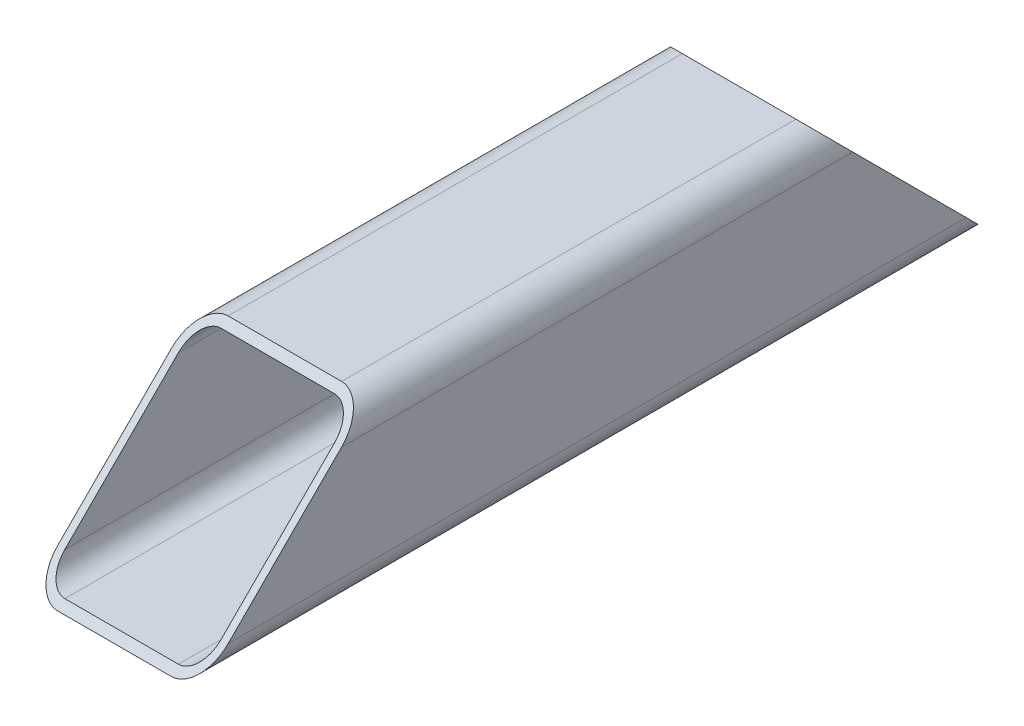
ISO-10303-21;
HEADER;
FILE_DESCRIPTION(('STEP AP214'),'2;1');
FILE_NAME('part.step','',(''),(''),'','','');
FILE_SCHEMA(('AUTOMOTIVE_DESIGN { 1 0 10303 214 1 1 1 1 }'));
ENDSEC;
DATA;
#1=APPLICATION_CONTEXT('core data for automotive mechanical design processes');
#2=APPLICATION_PROTOCOL_DEFINITION('international standard','automotive_design',2000,#1);
#3=PRODUCT_CONTEXT('',#1,'mechanical');
#4=PRODUCT('Part','Part','',(#3));
#5=PRODUCT_RELATED_PRODUCT_CATEGORY('part','',(#4));
#6=PRODUCT_DEFINITION_FORMATION('','',#4);
#7=PRODUCT_DEFINITION_CONTEXT('part definition',#1,'design');
#8=PRODUCT_DEFINITION('design','',#6,#7);
#9=PRODUCT_DEFINITION_SHAPE('','',#8);
#10=(LENGTH_UNIT() NAMED_UNIT(*) SI_UNIT(.MILLI.,.METRE.));
#11=(NAMED_UNIT(*) PLANE_ANGLE_UNIT() SI_UNIT($,.RADIAN.));
#12=(NAMED_UNIT(*) SI_UNIT($,.STERADIAN.) SOLID_ANGLE_UNIT());
#13=UNCERTAINTY_MEASURE_WITH_UNIT(LENGTH_MEASURE(1.E-05),#10,'distance_accuracy_value','');
#14=(GEOMETRIC_REPRESENTATION_CONTEXT(3) GLOBAL_UNCERTAINTY_ASSIGNED_CONTEXT((#13)) GLOBAL_UNIT_ASSIGNED_CONTEXT((#10,
#11,#12)) REPRESENTATION_CONTEXT('',''));
#15=CARTESIAN_POINT('',(0.,0.,0.));
#16=DIRECTION('',(0.,0.,1.));
#17=DIRECTION('',(1.,0.,0.));
#18=AXIS2_PLACEMENT_3D('',#15,#16,#17);
#19=CARTESIAN_POINT('',(25.4,25.4,355.6));
#20=DIRECTION('',(0.,0.,-1.));
#21=DIRECTION('',(-1.,0.,0.));
#22=AXIS2_PLACEMENT_3D('',#19,#20,#21);
#23=CYLINDRICAL_SURFACE('',#22,12.7);
#24=DIRECTION('',(0.,0.,-1.));
#25=VECTOR('',#24,1.);
#26=CARTESIAN_POINT('',(38.1,25.4,355.6));
#27=LINE('',#26,#25);
#28=CARTESIAN_POINT('',(38.1,25.4,292.1));
#29=VERTEX_POINT('',#28);
#30=CARTESIAN_POINT('',(38.1,25.4,63.5000000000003));
#31=VERTEX_POINT('',#30);
#32=EDGE_CURVE('E177',#29,#31,#27,.T.);
#33=ORIENTED_EDGE('',*,*,#32,.T.);
#34=CARTESIAN_POINT('',(25.4,25.4,63.5000000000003));
#35=DIRECTION('',(0.,-0.707106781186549,0.707106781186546));
#36=DIRECTION('',(0.,-0.707106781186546,-0.707106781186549));
#37=AXIS2_PLACEMENT_3D('',#34,#35,#36);
#38=ELLIPSE('',#37,17.9605122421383,12.7);
#39=CARTESIAN_POINT('',(25.4,38.1,76.2000000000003));
#40=VERTEX_POINT('',#39);
#41=EDGE_CURVE('E48',#31,#40,#38,.T.);
#42=ORIENTED_EDGE('',*,*,#41,.T.);
#43=DIRECTION('',(0.,0.,-1.));
#44=VECTOR('',#43,1.);
#45=CARTESIAN_POINT('',(25.4,38.1,355.6));
#46=LINE('',#45,#44);
#47=CARTESIAN_POINT('',(25.4,38.1,279.4));
#48=VERTEX_POINT('',#47);
#49=EDGE_CURVE('E41',#48,#40,#46,.T.);
#50=ORIENTED_EDGE('',*,*,#49,.F.);
#51=CARTESIAN_POINT('',(25.4,25.4,292.1));
#52=DIRECTION('',(0.,0.707106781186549,0.707106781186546));
#53=DIRECTION('',(0.,0.707106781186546,-0.707106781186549));
#54=AXIS2_PLACEMENT_3D('',#51,#52,#53);
#55=ELLIPSE('',#54,17.9605122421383,12.7);
#56=EDGE_CURVE('E256',#29,#48,#55,.T.);
#57=ORIENTED_EDGE('',*,*,#56,.F.);
#58=EDGE_LOOP('',(#33,#42,#50,#57));
#59=FACE_BOUND('',#58,.T.);
#60=ADVANCED_FACE('F34',(#59),#23,.T.);
#61=CARTESIAN_POINT('',(-25.4,38.1,355.6));
#62=DIRECTION('',(0.,1.,0.));
#63=DIRECTION('',(-1.,0.,0.));
#64=AXIS2_PLACEMENT_3D('',#61,#62,#63);
#65=PLANE('',#64);
#66=DIRECTION('',(-1.,0.,0.));
#67=VECTOR('',#66,1.);
#68=CARTESIAN_POINT('',(38.1,38.1,76.2000000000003));
#69=LINE('',#68,#67);
#70=CARTESIAN_POINT('',(-25.4,38.1,76.2000000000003));
#71=VERTEX_POINT('',#70);
#72=EDGE_CURVE('E55',#40,#71,#69,.T.);
#73=ORIENTED_EDGE('',*,*,#72,.T.);
#74=DIRECTION('',(0.,0.,-1.));
#75=VECTOR('',#74,1.);
#76=CARTESIAN_POINT('',(-25.4,38.1,355.6));
#77=LINE('',#76,#75);
#78=CARTESIAN_POINT('',(-25.4,38.1,279.4));
#79=VERTEX_POINT('',#78);
#80=EDGE_CURVE('E192',#79,#71,#77,.T.);
#81=ORIENTED_EDGE('',*,*,#80,.F.);
#82=DIRECTION('',(-1.,0.,0.));
#83=VECTOR('',#82,1.);
#84=CARTESIAN_POINT('',(38.1,38.1,279.4));
#85=LINE('',#84,#83);
#86=EDGE_CURVE('E195',#48,#79,#85,.T.);
#87=ORIENTED_EDGE('',*,*,#86,.F.);
#88=ORIENTED_EDGE('',*,*,#49,.T.);
#89=EDGE_LOOP('',(#73,#81,#87,#88));
#90=FACE_BOUND('',#89,.T.);
#91=ADVANCED_FACE('F193',(#90),#65,.T.);
#92=CARTESIAN_POINT('',(-25.4,25.4,355.6));
#93=DIRECTION('',(0.,0.,-1.));
#94=DIRECTION('',(-1.,0.,0.));
#95=AXIS2_PLACEMENT_3D('',#92,#93,#94);
#96=CYLINDRICAL_SURFACE('',#95,12.7);
#97=CARTESIAN_POINT('',(-25.4,25.4,63.5000000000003));
#98=DIRECTION('',(0.,-0.707106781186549,0.707106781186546));
#99=DIRECTION('',(0.,-0.707106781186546,-0.707106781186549));
#100=AXIS2_PLACEMENT_3D('',#97,#98,#99);
#101=ELLIPSE('',#100,17.9605122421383,12.7);
#102=CARTESIAN_POINT('',(-38.1,25.4,63.5000000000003));
#103=VERTEX_POINT('',#102);
#104=EDGE_CURVE('E199',#103,#71,#101,.F.);
#105=ORIENTED_EDGE('',*,*,#104,.F.);
#106=DIRECTION('',(0.,0.,-1.));
#107=VECTOR('',#106,1.);
#108=CARTESIAN_POINT('',(-38.1,25.4,355.6));
#109=LINE('',#108,#107);
#110=CARTESIAN_POINT('',(-38.1,25.4000000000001,292.1));
#111=VERTEX_POINT('',#110);
#112=EDGE_CURVE('E189',#111,#103,#109,.T.);
#113=ORIENTED_EDGE('',*,*,#112,.F.);
#114=CARTESIAN_POINT('',(-25.4,25.4,292.1));
#115=DIRECTION('',(0.,0.707106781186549,0.707106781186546));
#116=DIRECTION('',(0.,0.707106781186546,-0.707106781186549));
#117=AXIS2_PLACEMENT_3D('',#114,#115,#116);
#118=ELLIPSE('',#117,17.9605122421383,12.7);
#119=EDGE_CURVE('E254',#111,#79,#118,.F.);
#120=ORIENTED_EDGE('',*,*,#119,.T.);
#121=ORIENTED_EDGE('',*,*,#80,.T.);
#122=EDGE_LOOP('',(#105,#113,#120,#121));
#123=FACE_BOUND('',#122,.T.);
#124=ADVANCED_FACE('F327',(#123),#96,.T.);
#125=CARTESIAN_POINT('',(-38.1,25.4,355.6));
#126=DIRECTION('',(1.,0.,0.));
#127=DIRECTION('',(0.,1.,0.));
#128=AXIS2_PLACEMENT_3D('',#125,#126,#127);
#129=PLANE('',#128);
#130=ORIENTED_EDGE('',*,*,#112,.T.);
#131=DIRECTION('',(0.,-0.707106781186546,-0.707106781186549));
#132=VECTOR('',#131,1.);
#133=CARTESIAN_POINT('',(-38.1,171.45,209.550000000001));
#134=LINE('',#133,#132);
#135=CARTESIAN_POINT('',(-38.1,-25.4,12.7));
#136=VERTEX_POINT('',#135);
#137=EDGE_CURVE('E170',#103,#136,#134,.T.);
#138=ORIENTED_EDGE('',*,*,#137,.T.);
#139=DIRECTION('',(0.,0.,-1.));
#140=VECTOR('',#139,1.);
#141=CARTESIAN_POINT('',(-38.1,-25.4,355.6));
#142=LINE('',#141,#140);
#143=CARTESIAN_POINT('',(-38.1,-25.4,342.9));
#144=VERTEX_POINT('',#143);
#145=EDGE_CURVE('E160',#144,#136,#142,.T.);
#146=ORIENTED_EDGE('',*,*,#145,.F.);
#147=DIRECTION('',(0.,-0.707106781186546,0.707106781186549));
#148=VECTOR('',#147,1.);
#149=CARTESIAN_POINT('',(-38.1,-6.35000000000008,323.85));
#150=LINE('',#149,#148);
#151=EDGE_CURVE('E251',#111,#144,#150,.T.);
#152=ORIENTED_EDGE('',*,*,#151,.F.);
#153=EDGE_LOOP('',(#130,#138,#146,#152));
#154=FACE_BOUND('',#153,.T.);
#155=ADVANCED_FACE('F336',(#154),#129,.F.);
#156=CARTESIAN_POINT('',(-25.4,-25.4,355.6));
#157=DIRECTION('',(0.,0.,-1.));
#158=DIRECTION('',(-1.,0.,0.));
#159=AXIS2_PLACEMENT_3D('',#156,#157,#158);
#160=CYLINDRICAL_SURFACE('',#159,12.7);
#161=CARTESIAN_POINT('',(-25.4,-25.4,12.7));
#162=DIRECTION('',(0.,-0.707106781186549,0.707106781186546));
#163=DIRECTION('',(0.,-0.707106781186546,-0.707106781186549));
#164=AXIS2_PLACEMENT_3D('',#161,#162,#163);
#165=ELLIPSE('',#164,17.9605122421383,12.7);
#166=CARTESIAN_POINT('',(-25.4,-38.1,0.));
#167=VERTEX_POINT('',#166);
#168=EDGE_CURVE('E165',#167,#136,#165,.F.);
#169=ORIENTED_EDGE('',*,*,#168,.F.);
#170=DIRECTION('',(0.,0.,-1.));
#171=VECTOR('',#170,1.);
#172=CARTESIAN_POINT('',(-25.4,-38.1,355.6));
#173=LINE('',#172,#171);
#174=CARTESIAN_POINT('',(-25.4,-38.1,355.6));
#175=VERTEX_POINT('',#174);
#176=EDGE_CURVE('E149',#175,#167,#173,.T.);
#177=ORIENTED_EDGE('',*,*,#176,.F.);
#178=CARTESIAN_POINT('',(-25.4,-25.4,342.9));
#179=DIRECTION('',(0.,0.707106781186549,0.707106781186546));
#180=DIRECTION('',(0.,0.707106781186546,-0.707106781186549));
#181=AXIS2_PLACEMENT_3D('',#178,#179,#180);
#182=ELLIPSE('',#181,17.9605122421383,12.7);
#183=EDGE_CURVE('E249',#175,#144,#182,.F.);
#184=ORIENTED_EDGE('',*,*,#183,.T.);
#185=ORIENTED_EDGE('',*,*,#145,.T.);
#186=EDGE_LOOP('',(#169,#177,#184,#185));
#187=FACE_BOUND('',#186,.T.);
#188=ADVANCED_FACE('F166',(#187),#160,.T.);
#189=CARTESIAN_POINT('',(25.4,-25.4,355.6));
#190=DIRECTION('',(0.,0.,-1.));
#191=DIRECTION('',(-1.,0.,0.));
#192=AXIS2_PLACEMENT_3D('',#189,#190,#191);
#193=CYLINDRICAL_SURFACE('',#192,12.7);
#194=CARTESIAN_POINT('',(25.4,-25.4,12.7));
#195=DIRECTION('',(0.,-0.707106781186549,0.707106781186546));
#196=DIRECTION('',(0.,-0.707106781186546,-0.707106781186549));
#197=AXIS2_PLACEMENT_3D('',#194,#195,#196);
#198=ELLIPSE('',#197,17.9605122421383,12.7);
#199=CARTESIAN_POINT('',(38.1,-25.4000000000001,12.7));
#200=VERTEX_POINT('',#199);
#201=CARTESIAN_POINT('',(25.4,-38.1,0.));
#202=VERTEX_POINT('',#201);
#203=EDGE_CURVE('E171',#200,#202,#198,.F.);
#204=ORIENTED_EDGE('',*,*,#203,.F.);
#205=DIRECTION('',(0.,0.,-1.));
#206=VECTOR('',#205,1.);
#207=CARTESIAN_POINT('',(38.1,-25.4000000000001,355.6));
#208=LINE('',#207,#206);
#209=CARTESIAN_POINT('',(38.1,-25.4000000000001,342.9));
#210=VERTEX_POINT('',#209);
#211=EDGE_CURVE('E184',#210,#200,#208,.T.);
#212=ORIENTED_EDGE('',*,*,#211,.F.);
#213=CARTESIAN_POINT('',(25.4,-25.4,342.9));
#214=DIRECTION('',(0.,0.707106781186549,0.707106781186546));
#215=DIRECTION('',(0.,0.707106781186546,-0.707106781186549));
#216=AXIS2_PLACEMENT_3D('',#213,#214,#215);
#217=ELLIPSE('',#216,17.9605122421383,12.7);
#218=CARTESIAN_POINT('',(25.4,-38.1,355.6));
#219=VERTEX_POINT('',#218);
#220=EDGE_CURVE('E247',#210,#219,#217,.F.);
#221=ORIENTED_EDGE('',*,*,#220,.T.);
#222=DIRECTION('',(0.,0.,-1.));
#223=VECTOR('',#222,1.);
#224=CARTESIAN_POINT('',(25.4,-38.1,355.6));
#225=LINE('',#224,#223);
#226=EDGE_CURVE('E161',#219,#202,#225,.T.);
#227=ORIENTED_EDGE('',*,*,#226,.T.);
#228=EDGE_LOOP('',(#204,#212,#221,#227));
#229=FACE_BOUND('',#228,.T.);
#230=ADVANCED_FACE('F333',(#229),#193,.T.);
#231=CARTESIAN_POINT('',(38.1,-25.4000000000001,355.6));
#232=DIRECTION('',(-1.,0.,0.));
#233=DIRECTION('',(0.,-1.,0.));
#234=AXIS2_PLACEMENT_3D('',#231,#232,#233);
#235=PLANE('',#234);
#236=ORIENTED_EDGE('',*,*,#211,.T.);
#237=DIRECTION('',(0.,0.707106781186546,0.707106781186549));
#238=VECTOR('',#237,1.);
#239=CARTESIAN_POINT('',(38.1,-38.1,0.));
#240=LINE('',#239,#238);
#241=EDGE_CURVE('E201',#200,#31,#240,.T.);
#242=ORIENTED_EDGE('',*,*,#241,.T.);
#243=ORIENTED_EDGE('',*,*,#32,.F.);
#244=DIRECTION('',(0.,0.707106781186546,-0.707106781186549));
#245=VECTOR('',#244,1.);
#246=CARTESIAN_POINT('',(38.1,-38.1,355.6));
#247=LINE('',#246,#245);
#248=EDGE_CURVE('E227',#210,#29,#247,.T.);
#249=ORIENTED_EDGE('',*,*,#248,.F.);
#250=EDGE_LOOP('',(#236,#242,#243,#249));
#251=FACE_BOUND('',#250,.T.);
#252=ADVANCED_FACE('F329',(#251),#235,.F.);
#253=CARTESIAN_POINT('',(25.4,25.4,355.6));
#254=DIRECTION('',(0.,0.,-1.));
#255=DIRECTION('',(-1.,0.,0.));
#256=AXIS2_PLACEMENT_3D('',#253,#254,#255);
#257=CYLINDRICAL_SURFACE('',#256,9.525);
#258=CARTESIAN_POINT('',(25.4,25.4,63.5000000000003));
#259=DIRECTION('',(0.,-0.707106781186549,0.707106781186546));
#260=DIRECTION('',(0.,-0.707106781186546,-0.707106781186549));
#261=AXIS2_PLACEMENT_3D('',#258,#259,#260);
#262=ELLIPSE('',#261,13.4703841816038,9.525);
#263=CARTESIAN_POINT('',(34.925,25.4,63.5000000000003));
#264=VERTEX_POINT('',#263);
#265=CARTESIAN_POINT('',(25.4,34.925,73.0250000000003));
#266=VERTEX_POINT('',#265);
#267=EDGE_CURVE('E220',#264,#266,#262,.T.);
#268=ORIENTED_EDGE('',*,*,#267,.F.);
#269=DIRECTION('',(0.,0.,-1.));
#270=VECTOR('',#269,1.);
#271=CARTESIAN_POINT('',(34.925,25.4,355.6));
#272=LINE('',#271,#270);
#273=CARTESIAN_POINT('',(34.925,25.4,292.1));
#274=VERTEX_POINT('',#273);
#275=EDGE_CURVE('E258',#274,#264,#272,.T.);
#276=ORIENTED_EDGE('',*,*,#275,.F.);
#277=CARTESIAN_POINT('',(25.4,25.4,292.1));
#278=DIRECTION('',(0.,0.707106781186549,0.707106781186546));
#279=DIRECTION('',(0.,0.707106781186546,-0.707106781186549));
#280=AXIS2_PLACEMENT_3D('',#277,#278,#279);
#281=ELLIPSE('',#280,13.4703841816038,9.525);
#282=CARTESIAN_POINT('',(25.4,34.925,282.575));
#283=VERTEX_POINT('',#282);
#284=EDGE_CURVE('E244',#274,#283,#281,.T.);
#285=ORIENTED_EDGE('',*,*,#284,.T.);
#286=DIRECTION('',(0.,0.,-1.));
#287=VECTOR('',#286,1.);
#288=CARTESIAN_POINT('',(25.4,34.925,355.6));
#289=LINE('',#288,#287);
#290=EDGE_CURVE('E175',#283,#266,#289,.T.);
#291=ORIENTED_EDGE('',*,*,#290,.T.);
#292=EDGE_LOOP('',(#268,#276,#285,#291));
#293=FACE_BOUND('',#292,.T.);
#294=ADVANCED_FACE('F290',(#293),#257,.F.);
#295=CARTESIAN_POINT('',(-25.4,34.925,355.6));
#296=DIRECTION('',(0.,1.,0.));
#297=DIRECTION('',(-1.,0.,0.));
#298=AXIS2_PLACEMENT_3D('',#295,#296,#297);
#299=PLANE('',#298);
#300=DIRECTION('',(0.,0.,-1.));
#301=VECTOR('',#300,1.);
#302=CARTESIAN_POINT('',(-25.4,34.925,355.6));
#303=LINE('',#302,#301);
#304=CARTESIAN_POINT('',(-25.4,34.925,282.575));
#305=VERTEX_POINT('',#304);
#306=CARTESIAN_POINT('',(-25.4,34.925,73.0250000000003));
#307=VERTEX_POINT('',#306);
#308=EDGE_CURVE('E180',#305,#307,#303,.T.);
#309=ORIENTED_EDGE('',*,*,#308,.T.);
#310=DIRECTION('',(1.,0.,0.));
#311=VECTOR('',#310,1.);
#312=CARTESIAN_POINT('',(-25.3999999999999,34.925,73.0250000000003));
#313=LINE('',#312,#311);
#314=EDGE_CURVE('E218',#307,#266,#313,.T.);
#315=ORIENTED_EDGE('',*,*,#314,.T.);
#316=ORIENTED_EDGE('',*,*,#290,.F.);
#317=DIRECTION('',(1.,0.,0.));
#318=VECTOR('',#317,1.);
#319=CARTESIAN_POINT('',(-25.4,34.925,282.575));
#320=LINE('',#319,#318);
#321=EDGE_CURVE('E242',#305,#283,#320,.T.);
#322=ORIENTED_EDGE('',*,*,#321,.F.);
#323=EDGE_LOOP('',(#309,#315,#316,#322));
#324=FACE_BOUND('',#323,.T.);
#325=ADVANCED_FACE('F280',(#324),#299,.F.);
#326=CARTESIAN_POINT('',(-25.4,25.4,355.6));
#327=DIRECTION('',(0.,0.,-1.));
#328=DIRECTION('',(-1.,0.,0.));
#329=AXIS2_PLACEMENT_3D('',#326,#327,#328);
#330=CYLINDRICAL_SURFACE('',#329,9.525);
#331=DIRECTION('',(0.,0.,-1.));
#332=VECTOR('',#331,1.);
#333=CARTESIAN_POINT('',(-34.925,25.4,355.6));
#334=LINE('',#333,#332);
#335=CARTESIAN_POINT('',(-34.925,25.4000000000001,292.1));
#336=VERTEX_POINT('',#335);
#337=CARTESIAN_POINT('',(-34.925,25.4,63.5000000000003));
#338=VERTEX_POINT('',#337);
#339=EDGE_CURVE('E272',#336,#338,#334,.T.);
#340=ORIENTED_EDGE('',*,*,#339,.T.);
#341=CARTESIAN_POINT('',(-25.4,25.4,63.5000000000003));
#342=DIRECTION('',(0.,-0.707106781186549,0.707106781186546));
#343=DIRECTION('',(0.,-0.707106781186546,-0.707106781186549));
#344=AXIS2_PLACEMENT_3D('',#341,#342,#343);
#345=ELLIPSE('',#344,13.4703841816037,9.525);
#346=EDGE_CURVE('E216',#338,#307,#345,.F.);
#347=ORIENTED_EDGE('',*,*,#346,.T.);
#348=ORIENTED_EDGE('',*,*,#308,.F.);
#349=CARTESIAN_POINT('',(-25.4,25.4,292.1));
#350=DIRECTION('',(0.,0.707106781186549,0.707106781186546));
#351=DIRECTION('',(0.,0.707106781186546,-0.707106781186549));
#352=AXIS2_PLACEMENT_3D('',#349,#350,#351);
#353=ELLIPSE('',#352,13.4703841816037,9.525);
#354=EDGE_CURVE('E240',#336,#305,#353,.F.);
#355=ORIENTED_EDGE('',*,*,#354,.F.);
#356=EDGE_LOOP('',(#340,#347,#348,#355));
#357=FACE_BOUND('',#356,.T.);
#358=ADVANCED_FACE('F314',(#357),#330,.F.);
#359=CARTESIAN_POINT('',(-34.925,25.4,355.6));
#360=DIRECTION('',(1.,0.,0.));
#361=DIRECTION('',(0.,1.,0.));
#362=AXIS2_PLACEMENT_3D('',#359,#360,#361);
#363=PLANE('',#362);
#364=DIRECTION('',(0.,-0.707106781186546,-0.707106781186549));
#365=VECTOR('',#364,1.);
#366=CARTESIAN_POINT('',(-34.925,171.45,209.550000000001));
#367=LINE('',#366,#365);
#368=CARTESIAN_POINT('',(-34.925,-25.4,12.7));
#369=VERTEX_POINT('',#368);
#370=EDGE_CURVE('E213',#338,#369,#367,.T.);
#371=ORIENTED_EDGE('',*,*,#370,.F.);
#372=ORIENTED_EDGE('',*,*,#339,.F.);
#373=DIRECTION('',(0.,-0.707106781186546,0.707106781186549));
#374=VECTOR('',#373,1.);
#375=CARTESIAN_POINT('',(-34.925,-6.35000000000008,323.85));
#376=LINE('',#375,#374);
#377=CARTESIAN_POINT('',(-34.925,-25.4,342.9));
#378=VERTEX_POINT('',#377);
#379=EDGE_CURVE('E237',#336,#378,#376,.T.);
#380=ORIENTED_EDGE('',*,*,#379,.T.);
#381=DIRECTION('',(0.,0.,-1.));
#382=VECTOR('',#381,1.);
#383=CARTESIAN_POINT('',(-34.925,-25.4,355.6));
#384=LINE('',#383,#382);
#385=EDGE_CURVE('E269',#378,#369,#384,.T.);
#386=ORIENTED_EDGE('',*,*,#385,.T.);
#387=EDGE_LOOP('',(#371,#372,#380,#386));
#388=FACE_BOUND('',#387,.T.);
#389=ADVANCED_FACE('F313',(#388),#363,.T.);
#390=CARTESIAN_POINT('',(-25.4,-25.4,355.6));
#391=DIRECTION('',(0.,0.,-1.));
#392=DIRECTION('',(-1.,0.,0.));
#393=AXIS2_PLACEMENT_3D('',#390,#391,#392);
#394=CYLINDRICAL_SURFACE('',#393,9.52499999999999);
#395=DIRECTION('',(0.,0.,-1.));
#396=VECTOR('',#395,1.);
#397=CARTESIAN_POINT('',(-25.4,-34.925,355.6));
#398=LINE('',#397,#396);
#399=CARTESIAN_POINT('',(-25.4,-34.925,352.425));
#400=VERTEX_POINT('',#399);
#401=CARTESIAN_POINT('',(-25.4,-34.925,3.17499999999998));
#402=VERTEX_POINT('',#401);
#403=EDGE_CURVE('E266',#400,#402,#398,.T.);
#404=ORIENTED_EDGE('',*,*,#403,.T.);
#405=CARTESIAN_POINT('',(-25.4,-25.4,12.7));
#406=DIRECTION('',(0.,-0.707106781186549,0.707106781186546));
#407=DIRECTION('',(0.,-0.707106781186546,-0.707106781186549));
#408=AXIS2_PLACEMENT_3D('',#405,#406,#407);
#409=ELLIPSE('',#408,13.4703841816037,9.52499999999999);
#410=EDGE_CURVE('E211',#402,#369,#409,.F.);
#411=ORIENTED_EDGE('',*,*,#410,.T.);
#412=ORIENTED_EDGE('',*,*,#385,.F.);
#413=CARTESIAN_POINT('',(-25.4,-25.4,342.9));
#414=DIRECTION('',(0.,0.707106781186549,0.707106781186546));
#415=DIRECTION('',(0.,0.707106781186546,-0.707106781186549));
#416=AXIS2_PLACEMENT_3D('',#413,#414,#415);
#417=ELLIPSE('',#416,13.4703841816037,9.52499999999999);
#418=EDGE_CURVE('E235',#400,#378,#417,.F.);
#419=ORIENTED_EDGE('',*,*,#418,.F.);
#420=EDGE_LOOP('',(#404,#411,#412,#419));
#421=FACE_BOUND('',#420,.T.);
#422=ADVANCED_FACE('F309',(#421),#394,.F.);
#423=CARTESIAN_POINT('',(25.4,-34.925,355.6));
#424=DIRECTION('',(0.,-1.,0.));
#425=DIRECTION('',(1.,0.,0.));
#426=AXIS2_PLACEMENT_3D('',#423,#424,#425);
#427=PLANE('',#426);
#428=DIRECTION('',(0.,0.,-1.));
#429=VECTOR('',#428,1.);
#430=CARTESIAN_POINT('',(25.4,-34.925,355.6));
#431=LINE('',#430,#429);
#432=CARTESIAN_POINT('',(25.4,-34.925,352.425));
#433=VERTEX_POINT('',#432);
#434=CARTESIAN_POINT('',(25.4,-34.925,3.17499999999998));
#435=VERTEX_POINT('',#434);
#436=EDGE_CURVE('E263',#433,#435,#431,.T.);
#437=ORIENTED_EDGE('',*,*,#436,.T.);
#438=DIRECTION('',(-1.,0.,0.));
#439=VECTOR('',#438,1.);
#440=CARTESIAN_POINT('',(25.4,-34.925,3.17499999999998));
#441=LINE('',#440,#439);
#442=EDGE_CURVE('E209',#435,#402,#441,.T.);
#443=ORIENTED_EDGE('',*,*,#442,.T.);
#444=ORIENTED_EDGE('',*,*,#403,.F.);
#445=DIRECTION('',(-1.,0.,0.));
#446=VECTOR('',#445,1.);
#447=CARTESIAN_POINT('',(25.4,-34.925,352.425));
#448=LINE('',#447,#446);
#449=EDGE_CURVE('E233',#433,#400,#448,.T.);
#450=ORIENTED_EDGE('',*,*,#449,.F.);
#451=EDGE_LOOP('',(#437,#443,#444,#450));
#452=FACE_BOUND('',#451,.T.);
#453=ADVANCED_FACE('F305',(#452),#427,.F.);
#454=CARTESIAN_POINT('',(25.4,-25.4,355.6));
#455=DIRECTION('',(0.,0.,-1.));
#456=DIRECTION('',(-1.,0.,0.));
#457=AXIS2_PLACEMENT_3D('',#454,#455,#456);
#458=CYLINDRICAL_SURFACE('',#457,9.525);
#459=DIRECTION('',(0.,0.,-1.));
#460=VECTOR('',#459,1.);
#461=CARTESIAN_POINT('',(34.925,-25.4000000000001,355.6));
#462=LINE('',#461,#460);
#463=CARTESIAN_POINT('',(34.925,-25.4000000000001,342.9));
#464=VERTEX_POINT('',#463);
#465=CARTESIAN_POINT('',(34.925,-25.4000000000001,12.7));
#466=VERTEX_POINT('',#465);
#467=EDGE_CURVE('E260',#464,#466,#462,.T.);
#468=ORIENTED_EDGE('',*,*,#467,.T.);
#469=CARTESIAN_POINT('',(25.4,-25.4,12.7));
#470=DIRECTION('',(0.,-0.707106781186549,0.707106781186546));
#471=DIRECTION('',(0.,-0.707106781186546,-0.707106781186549));
#472=AXIS2_PLACEMENT_3D('',#469,#470,#471);
#473=ELLIPSE('',#472,13.4703841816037,9.525);
#474=EDGE_CURVE('E204',#466,#435,#473,.F.);
#475=ORIENTED_EDGE('',*,*,#474,.T.);
#476=ORIENTED_EDGE('',*,*,#436,.F.);
#477=CARTESIAN_POINT('',(25.4,-25.4,342.9));
#478=DIRECTION('',(0.,0.707106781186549,0.707106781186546));
#479=DIRECTION('',(0.,0.707106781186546,-0.707106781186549));
#480=AXIS2_PLACEMENT_3D('',#477,#478,#479);
#481=ELLIPSE('',#480,13.4703841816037,9.525);
#482=EDGE_CURVE('E231',#464,#433,#481,.F.);
#483=ORIENTED_EDGE('',*,*,#482,.F.);
#484=EDGE_LOOP('',(#468,#475,#476,#483));
#485=FACE_BOUND('',#484,.T.);
#486=ADVANCED_FACE('F299',(#485),#458,.F.);
#487=CARTESIAN_POINT('',(34.925,-25.4000000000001,355.6));
#488=DIRECTION('',(-1.,0.,0.));
#489=DIRECTION('',(0.,-1.,0.));
#490=AXIS2_PLACEMENT_3D('',#487,#488,#489);
#491=PLANE('',#490);
#492=DIRECTION('',(0.,0.707106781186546,0.707106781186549));
#493=VECTOR('',#492,1.);
#494=CARTESIAN_POINT('',(34.9250000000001,146.05,184.150000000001));
#495=LINE('',#494,#493);
#496=EDGE_CURVE('E200',#466,#264,#495,.T.);
#497=ORIENTED_EDGE('',*,*,#496,.F.);
#498=ORIENTED_EDGE('',*,*,#467,.F.);
#499=DIRECTION('',(0.,0.707106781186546,-0.707106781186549));
#500=VECTOR('',#499,1.);
#501=CARTESIAN_POINT('',(34.925,-31.7500000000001,349.25));
#502=LINE('',#501,#500);
#503=EDGE_CURVE('E11',#464,#274,#502,.T.);
#504=ORIENTED_EDGE('',*,*,#503,.T.);
#505=ORIENTED_EDGE('',*,*,#275,.T.);
#506=EDGE_LOOP('',(#497,#498,#504,#505));
#507=FACE_BOUND('',#506,.T.);
#508=ADVANCED_FACE('F297',(#507),#491,.T.);
#509=CARTESIAN_POINT('',(25.4,-38.1,355.6));
#510=DIRECTION('',(0.,-1.,0.));
#511=DIRECTION('',(1.,0.,0.));
#512=AXIS2_PLACEMENT_3D('',#509,#510,#511);
#513=PLANE('',#512);
#514=DIRECTION('',(-1.,0.,0.));
#515=VECTOR('',#514,1.);
#516=CARTESIAN_POINT('',(25.4,-38.1,0.));
#517=LINE('',#516,#515);
#518=EDGE_CURVE('E154',#202,#167,#517,.T.);
#519=ORIENTED_EDGE('',*,*,#518,.F.);
#520=ORIENTED_EDGE('',*,*,#226,.F.);
#521=DIRECTION('',(-1.,0.,0.));
#522=VECTOR('',#521,1.);
#523=CARTESIAN_POINT('',(25.4,-38.1,355.6));
#524=LINE('',#523,#522);
#525=EDGE_CURVE('E157',#219,#175,#524,.T.);
#526=ORIENTED_EDGE('',*,*,#525,.T.);
#527=ORIENTED_EDGE('',*,*,#176,.T.);
#528=EDGE_LOOP('',(#519,#520,#526,#527));
#529=FACE_BOUND('',#528,.T.);
#530=ADVANCED_FACE('F151',(#529),#513,.T.);
#531=CARTESIAN_POINT('',(38.1,-38.1,355.6));
#532=DIRECTION('',(0.,0.707106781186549,0.707106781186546));
#533=DIRECTION('',(0.,-0.707106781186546,0.707106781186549));
#534=AXIS2_PLACEMENT_3D('',#531,#532,#533);
#535=PLANE('',#534);
#536=ORIENTED_EDGE('',*,*,#284,.F.);
#537=ORIENTED_EDGE('',*,*,#503,.F.);
#538=ORIENTED_EDGE('',*,*,#482,.T.);
#539=ORIENTED_EDGE('',*,*,#449,.T.);
#540=ORIENTED_EDGE('',*,*,#418,.T.);
#541=ORIENTED_EDGE('',*,*,#379,.F.);
#542=ORIENTED_EDGE('',*,*,#354,.T.);
#543=ORIENTED_EDGE('',*,*,#321,.T.);
#544=EDGE_LOOP('',(#536,#537,#538,#539,#540,#541,#542,#543));
#545=FACE_BOUND('',#544,.T.);
#546=ORIENTED_EDGE('',*,*,#248,.T.);
#547=ORIENTED_EDGE('',*,*,#56,.T.);
#548=ORIENTED_EDGE('',*,*,#86,.T.);
#549=ORIENTED_EDGE('',*,*,#119,.F.);
#550=ORIENTED_EDGE('',*,*,#151,.T.);
#551=ORIENTED_EDGE('',*,*,#183,.F.);
#552=ORIENTED_EDGE('',*,*,#525,.F.);
#553=ORIENTED_EDGE('',*,*,#220,.F.);
#554=EDGE_LOOP('',(#546,#547,#548,#549,#550,#551,#552,#553));
#555=FACE_BOUND('',#554,.T.);
#556=ADVANCED_FACE('F292',(#545,#555),#535,.T.);
#557=CARTESIAN_POINT('',(38.1,-38.1,0.));
#558=DIRECTION('',(0.,-0.707106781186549,0.707106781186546));
#559=DIRECTION('',(0.,-0.707106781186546,-0.707106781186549));
#560=AXIS2_PLACEMENT_3D('',#557,#558,#559);
#561=PLANE('',#560);
#562=ORIENTED_EDGE('',*,*,#496,.T.);
#563=ORIENTED_EDGE('',*,*,#267,.T.);
#564=ORIENTED_EDGE('',*,*,#314,.F.);
#565=ORIENTED_EDGE('',*,*,#346,.F.);
#566=ORIENTED_EDGE('',*,*,#370,.T.);
#567=ORIENTED_EDGE('',*,*,#410,.F.);
#568=ORIENTED_EDGE('',*,*,#442,.F.);
#569=ORIENTED_EDGE('',*,*,#474,.F.);
#570=EDGE_LOOP('',(#562,#563,#564,#565,#566,#567,#568,#569));
#571=FACE_BOUND('',#570,.T.);
#572=ORIENTED_EDGE('',*,*,#41,.F.);
#573=ORIENTED_EDGE('',*,*,#241,.F.);
#574=ORIENTED_EDGE('',*,*,#203,.T.);
#575=ORIENTED_EDGE('',*,*,#518,.T.);
#576=ORIENTED_EDGE('',*,*,#168,.T.);
#577=ORIENTED_EDGE('',*,*,#137,.F.);
#578=ORIENTED_EDGE('',*,*,#104,.T.);
#579=ORIENTED_EDGE('',*,*,#72,.F.);
#580=EDGE_LOOP('',(#572,#573,#574,#575,#576,#577,#578,#579));
#581=FACE_BOUND('',#580,.T.);
#582=ADVANCED_FACE('F173',(#571,#581),#561,.F.);
#583=CLOSED_SHELL('',(#60,#91,#124,#155,#188,#230,#252,#294,#325,#358,#389,#422,#453,#486,#508,
#530,#556,#582));
#584=MANIFOLD_SOLID_BREP('B2',#583);
#585=ADVANCED_BREP_SHAPE_REPRESENTATION('',(#18,#584),#14);
#586=SHAPE_DEFINITION_REPRESENTATION(#9,#585);
ENDSEC;
END-ISO-10303-21;
